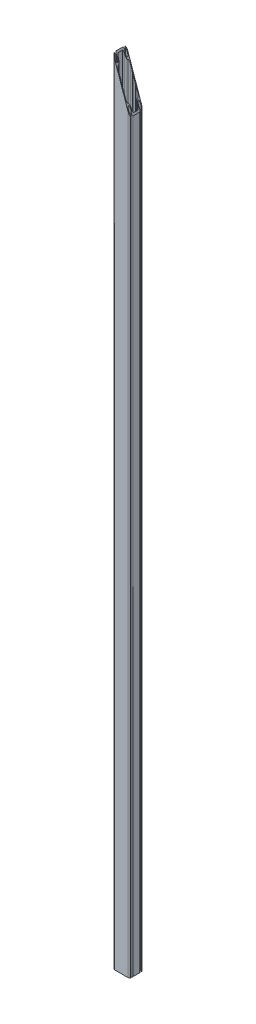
from build123d import *

# Parameters (mm, degrees)
SALIENTE_EXTRUIR1_DEPTH = 4753
CORTAR_EXTRUIR1_DEPTH   = 4754.936158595


with BuildPart() as part:
    # Croquis1 → Saliente-Extruir1 (new body)
    with BuildSketch(Plane(origin=(0, 0, 0), x_dir=(1, 0, 0), z_dir=(0, 1, 0))):
        with BuildLine():
            Line((39.5, -51.654327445), (-39.5, -51.654327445))
            ThreePointArc((-39.5, -51.654327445), (-45.378848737, -49.854277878), (-49.242036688, -45.071306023))
            ThreePointArc((-49.242036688, -45.071306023), (-48.132501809, -42.469588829), (-45.530784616, -43.579123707))
            ThreePointArc((-45.530784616, -43.579123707), (-33.301534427, -43.111116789), (-43.045454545, -35.706414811))
            ThreePointArc((-43.045454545, -35.706414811), (-47.645290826, -35.890503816), (-50, -31.934782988))
            Line((-50, -31.934782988), (-50, 8.626128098))
            ThreePointArc((-50, 8.626128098), (-47.645290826, 12.581848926), (-43.045454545, 12.397759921))
            ThreePointArc((-43.045454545, 12.397759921), (-33.301534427, 19.8024619), (-45.530784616, 20.270468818))
            ThreePointArc((-45.530784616, 20.270468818), (-48.132501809, 19.16093394), (-49.242036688, 21.762651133))
            ThreePointArc((-49.242036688, 21.762651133), (-45.378848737, 26.545622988), (-39.5, 28.345672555))
            Line((-39.5, 28.345672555), (39.5, 28.345672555))
            ThreePointArc((39.5, 28.345672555), (45.378848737, 26.545622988), (49.242036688, 21.762651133))
            ThreePointArc((49.242036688, 21.762651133), (48.132501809, 19.16093394), (45.530784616, 20.270468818))
            ThreePointArc((45.530784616, 20.270468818), (33.301534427, 19.8024619), (43.045454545, 12.397759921))
            ThreePointArc((43.045454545, 12.397759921), (47.645290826, 12.581848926), (50, 8.626128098))
            Line((50, 8.626128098), (50, -31.934782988))
            ThreePointArc((50, -31.934782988), (47.645290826, -35.890503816), (43.045454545, -35.706414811))
            ThreePointArc((43.045454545, -35.706414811), (33.301534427, -43.111116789), (45.530784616, -43.579123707))
            ThreePointArc((45.530784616, -43.579123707), (48.132501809, -42.469588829), (49.242036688, -45.071306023))
            ThreePointArc((49.242036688, -45.071306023), (45.378848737, -49.854277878), (39.5, -51.654327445))
        make_face()
        with BuildLine():
            Line((22.5, 24.345672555), (12.5, 24.345672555))
            Line((12.5, 24.345672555), (11, 22.845672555))
            Line((11, 22.845672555), (8, 22.845672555))
            Line((8, 22.845672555), (6.5, 24.345672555))
            Line((6.5, 24.345672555), (-6.5, 24.345672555))
            Line((-6.5, 24.345672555), (-8, 22.845672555))
            Line((-8, 22.845672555), (-11, 22.845672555))
            Line((-11, 22.845672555), (-12.5, 24.345672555))
            Line((-12.5, 24.345672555), (-22.5, 24.345672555))
            ThreePointArc((-22.5, 24.345672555), (-27.096194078, 22.441866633), (-29, 17.845672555))
            ThreePointArc((-29, 17.845672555), (-32.075378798, 10.421051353), (-39.5, 7.345672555))
            ThreePointArc((-39.5, 7.345672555), (-44.096194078, 5.441866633), (-46, 0.845672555))
            Line((-46, 0.845672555), (-46, -24.154327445))
            ThreePointArc((-46, -24.154327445), (-44.096194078, -28.750521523), (-39.5, -30.654327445))
            ThreePointArc((-39.5, -30.654327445), (-32.075378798, -33.729706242), (-29, -41.154327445))
            ThreePointArc((-29, -41.154327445), (-27.096194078, -45.750521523), (-22.5, -47.654327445))
            Line((-22.5, -47.654327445), (-12.5, -47.654327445))
            Line((-12.5, -47.654327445), (-11, -46.154327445))
            Line((-11, -46.154327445), (-8, -46.154327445))
            Line((-8, -46.154327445), (-6.5, -47.654327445))
            Line((-6.5, -47.654327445), (6.5, -47.654327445))
            Line((6.5, -47.654327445), (8, -46.154327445))
            Line((8, -46.154327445), (11, -46.154327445))
            Line((11, -46.154327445), (12.5, -47.654327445))
            Line((12.5, -47.654327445), (22.5, -47.654327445))
            ThreePointArc((22.5, -47.654327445), (27.096194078, -45.750521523), (29, -41.154327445))
            ThreePointArc((29, -41.154327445), (32.075378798, -33.729706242), (39.5, -30.654327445))
            ThreePointArc((39.5, -30.654327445), (44.096194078, -28.750521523), (46, -24.154327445))
            Line((46, -24.154327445), (46, 0.845672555))
            ThreePointArc((46, 0.845672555), (44.096194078, 5.441866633), (39.5, 7.345672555))
            ThreePointArc((39.5, 7.345672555), (32.075378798, 10.421051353), (29, 17.845672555))
            ThreePointArc((29, 17.845672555), (27.096194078, 22.441866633), (22.5, 24.345672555))
        make_face(mode=Mode.SUBTRACT)
    extrude(amount=SALIENTE_EXTRUIR1_DEPTH)

    # Croquis2 → Cortar-Extruir1 (cut, through all)
    with BuildSketch(Plane.XY.offset(51.654327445)):
        Polygon((-50, 4753), (50, 4464.542913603), (50, 4753), align=None)
    extrude(amount=-CORTAR_EXTRUIR1_DEPTH, mode=Mode.SUBTRACT)


solid = part.part
